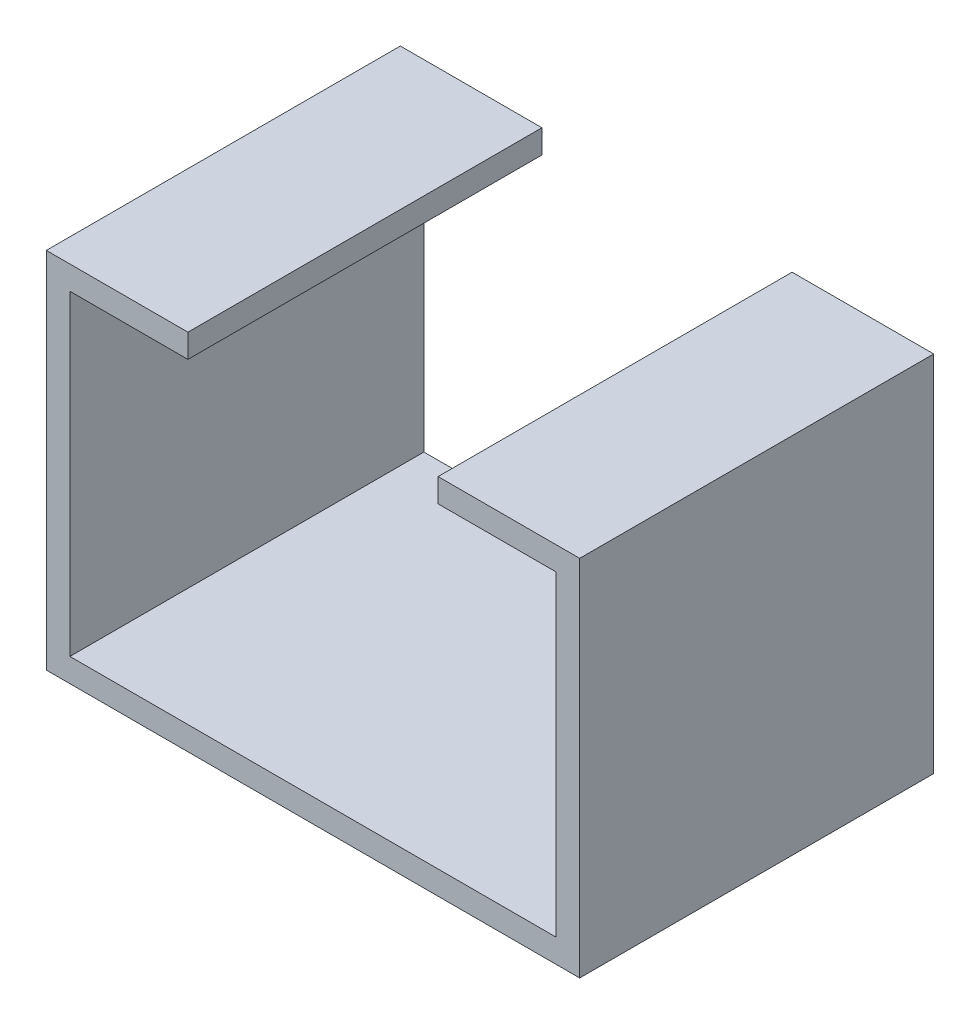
ISO-10303-21;
HEADER;
FILE_DESCRIPTION(('STEP AP214'),'2;1');
FILE_NAME('part.step','',(''),(''),'','','');
FILE_SCHEMA(('AUTOMOTIVE_DESIGN { 1 0 10303 214 1 1 1 1 }'));
ENDSEC;
DATA;
#1=APPLICATION_CONTEXT('core data for automotive mechanical design processes');
#2=APPLICATION_PROTOCOL_DEFINITION('international standard','automotive_design',2000,#1);
#3=PRODUCT_CONTEXT('',#1,'mechanical');
#4=PRODUCT('Part','Part','',(#3));
#5=PRODUCT_RELATED_PRODUCT_CATEGORY('part','',(#4));
#6=PRODUCT_DEFINITION_FORMATION('','',#4);
#7=PRODUCT_DEFINITION_CONTEXT('part definition',#1,'design');
#8=PRODUCT_DEFINITION('design','',#6,#7);
#9=PRODUCT_DEFINITION_SHAPE('','',#8);
#10=(LENGTH_UNIT() NAMED_UNIT(*) SI_UNIT(.MILLI.,.METRE.));
#11=(NAMED_UNIT(*) PLANE_ANGLE_UNIT() SI_UNIT($,.RADIAN.));
#12=(NAMED_UNIT(*) SI_UNIT($,.STERADIAN.) SOLID_ANGLE_UNIT());
#13=UNCERTAINTY_MEASURE_WITH_UNIT(LENGTH_MEASURE(1.E-05),#10,'distance_accuracy_value','');
#14=(GEOMETRIC_REPRESENTATION_CONTEXT(3) GLOBAL_UNCERTAINTY_ASSIGNED_CONTEXT((#13)) GLOBAL_UNIT_ASSIGNED_CONTEXT((#10,
#11,#12)) REPRESENTATION_CONTEXT('',''));
#15=CARTESIAN_POINT('',(0.,0.,0.));
#16=DIRECTION('',(0.,0.,1.));
#17=DIRECTION('',(1.,0.,0.));
#18=AXIS2_PLACEMENT_3D('',#15,#16,#17);
#19=CARTESIAN_POINT('',(0.,0.,15.));
#20=DIRECTION('',(-1.,0.,0.));
#21=DIRECTION('',(0.,0.,1.));
#22=AXIS2_PLACEMENT_3D('',#19,#20,#21);
#23=PLANE('',#22);
#24=DIRECTION('',(0.,1.,0.));
#25=VECTOR('',#24,1.);
#26=CARTESIAN_POINT('',(0.,0.,0.));
#27=LINE('',#26,#25);
#28=CARTESIAN_POINT('',(0.,0.,0.));
#29=VERTEX_POINT('',#28);
#30=CARTESIAN_POINT('',(0.,13.4,0.));
#31=VERTEX_POINT('',#30);
#32=EDGE_CURVE('E122',#29,#31,#27,.T.);
#33=ORIENTED_EDGE('',*,*,#32,.T.);
#34=DIRECTION('',(0.,0.,-1.));
#35=VECTOR('',#34,1.);
#36=CARTESIAN_POINT('',(0.,13.4,15.));
#37=LINE('',#36,#35);
#38=CARTESIAN_POINT('',(0.,13.4,15.));
#39=VERTEX_POINT('',#38);
#40=EDGE_CURVE('E11',#39,#31,#37,.T.);
#41=ORIENTED_EDGE('',*,*,#40,.F.);
#42=DIRECTION('',(0.,1.,0.));
#43=VECTOR('',#42,1.);
#44=CARTESIAN_POINT('',(0.,0.,15.));
#45=LINE('',#44,#43);
#46=CARTESIAN_POINT('',(0.,0.,15.));
#47=VERTEX_POINT('',#46);
#48=EDGE_CURVE('E157',#47,#39,#45,.T.);
#49=ORIENTED_EDGE('',*,*,#48,.F.);
#50=DIRECTION('',(0.,0.,-1.));
#51=VECTOR('',#50,1.);
#52=CARTESIAN_POINT('',(0.,0.,15.));
#53=LINE('',#52,#51);
#54=EDGE_CURVE('E135',#47,#29,#53,.T.);
#55=ORIENTED_EDGE('',*,*,#54,.T.);
#56=EDGE_LOOP('',(#33,#41,#49,#55));
#57=FACE_BOUND('',#56,.T.);
#58=ADVANCED_FACE('F30',(#57),#23,.F.);
#59=CARTESIAN_POINT('',(0.,13.4,15.));
#60=DIRECTION('',(0.,1.,0.));
#61=DIRECTION('',(0.,0.,1.));
#62=AXIS2_PLACEMENT_3D('',#59,#60,#61);
#63=PLANE('',#62);
#64=DIRECTION('',(1.,0.,0.));
#65=VECTOR('',#64,1.);
#66=CARTESIAN_POINT('',(0.,13.4,0.));
#67=LINE('',#66,#65);
#68=CARTESIAN_POINT('',(5.,13.4,0.));
#69=VERTEX_POINT('',#68);
#70=EDGE_CURVE('E118',#31,#69,#67,.T.);
#71=ORIENTED_EDGE('',*,*,#70,.T.);
#72=DIRECTION('',(0.,0.,-1.));
#73=VECTOR('',#72,1.);
#74=CARTESIAN_POINT('',(5.,13.4,15.));
#75=LINE('',#74,#73);
#76=CARTESIAN_POINT('',(5.,13.4,15.));
#77=VERTEX_POINT('',#76);
#78=EDGE_CURVE('E37',#77,#69,#75,.T.);
#79=ORIENTED_EDGE('',*,*,#78,.F.);
#80=DIRECTION('',(1.,0.,0.));
#81=VECTOR('',#80,1.);
#82=CARTESIAN_POINT('',(0.,13.4,15.));
#83=LINE('',#82,#81);
#84=EDGE_CURVE('E131',#39,#77,#83,.T.);
#85=ORIENTED_EDGE('',*,*,#84,.F.);
#86=ORIENTED_EDGE('',*,*,#40,.T.);
#87=EDGE_LOOP('',(#71,#79,#85,#86));
#88=FACE_BOUND('',#87,.T.);
#89=ADVANCED_FACE('F130',(#88),#63,.F.);
#90=CARTESIAN_POINT('',(5.,14.4,15.));
#91=DIRECTION('',(-1.,0.,0.));
#92=DIRECTION('',(0.,0.,1.));
#93=AXIS2_PLACEMENT_3D('',#90,#91,#92);
#94=PLANE('',#93);
#95=DIRECTION('',(0.,1.,0.));
#96=VECTOR('',#95,1.);
#97=CARTESIAN_POINT('',(5.,14.4,0.));
#98=LINE('',#97,#96);
#99=CARTESIAN_POINT('',(5.,14.4,0.));
#100=VERTEX_POINT('',#99);
#101=EDGE_CURVE('E124',#69,#100,#98,.T.);
#102=ORIENTED_EDGE('',*,*,#101,.T.);
#103=DIRECTION('',(0.,0.,-1.));
#104=VECTOR('',#103,1.);
#105=CARTESIAN_POINT('',(5.,14.4,15.));
#106=LINE('',#105,#104);
#107=CARTESIAN_POINT('',(5.,14.4,15.));
#108=VERTEX_POINT('',#107);
#109=EDGE_CURVE('E203',#108,#100,#106,.T.);
#110=ORIENTED_EDGE('',*,*,#109,.F.);
#111=DIRECTION('',(0.,1.,0.));
#112=VECTOR('',#111,1.);
#113=CARTESIAN_POINT('',(5.,14.4,15.));
#114=LINE('',#113,#112);
#115=EDGE_CURVE('E160',#77,#108,#114,.T.);
#116=ORIENTED_EDGE('',*,*,#115,.F.);
#117=ORIENTED_EDGE('',*,*,#78,.T.);
#118=EDGE_LOOP('',(#102,#110,#116,#117));
#119=FACE_BOUND('',#118,.T.);
#120=ADVANCED_FACE('F207',(#119),#94,.F.);
#121=CARTESIAN_POINT('',(-1.,14.4,15.));
#122=DIRECTION('',(0.,-1.,0.));
#123=DIRECTION('',(0.,0.,-1.));
#124=AXIS2_PLACEMENT_3D('',#121,#122,#123);
#125=PLANE('',#124);
#126=DIRECTION('',(-1.,0.,0.));
#127=VECTOR('',#126,1.);
#128=CARTESIAN_POINT('',(-1.,14.4,0.));
#129=LINE('',#128,#127);
#130=CARTESIAN_POINT('',(-1.,14.4,0.));
#131=VERTEX_POINT('',#130);
#132=EDGE_CURVE('E139',#100,#131,#129,.T.);
#133=ORIENTED_EDGE('',*,*,#132,.T.);
#134=DIRECTION('',(0.,0.,-1.));
#135=VECTOR('',#134,1.);
#136=CARTESIAN_POINT('',(-1.,14.4,15.));
#137=LINE('',#136,#135);
#138=CARTESIAN_POINT('',(-1.,14.4,15.));
#139=VERTEX_POINT('',#138);
#140=EDGE_CURVE('E200',#139,#131,#137,.T.);
#141=ORIENTED_EDGE('',*,*,#140,.F.);
#142=DIRECTION('',(-1.,0.,0.));
#143=VECTOR('',#142,1.);
#144=CARTESIAN_POINT('',(-1.,14.4,15.));
#145=LINE('',#144,#143);
#146=EDGE_CURVE('E162',#108,#139,#145,.T.);
#147=ORIENTED_EDGE('',*,*,#146,.F.);
#148=ORIENTED_EDGE('',*,*,#109,.T.);
#149=EDGE_LOOP('',(#133,#141,#147,#148));
#150=FACE_BOUND('',#149,.T.);
#151=ADVANCED_FACE('F215',(#150),#125,.F.);
#152=CARTESIAN_POINT('',(-1.,-1.,15.));
#153=DIRECTION('',(1.,0.,0.));
#154=DIRECTION('',(0.,0.,-1.));
#155=AXIS2_PLACEMENT_3D('',#152,#153,#154);
#156=PLANE('',#155);
#157=DIRECTION('',(0.,-1.,0.));
#158=VECTOR('',#157,1.);
#159=CARTESIAN_POINT('',(-1.,-1.,0.));
#160=LINE('',#159,#158);
#161=CARTESIAN_POINT('',(-1.,-1.,0.));
#162=VERTEX_POINT('',#161);
#163=EDGE_CURVE('E141',#131,#162,#160,.T.);
#164=ORIENTED_EDGE('',*,*,#163,.T.);
#165=DIRECTION('',(0.,0.,-1.));
#166=VECTOR('',#165,1.);
#167=CARTESIAN_POINT('',(-1.,-1.,15.));
#168=LINE('',#167,#166);
#169=CARTESIAN_POINT('',(-1.,-1.,15.));
#170=VERTEX_POINT('',#169);
#171=EDGE_CURVE('E197',#170,#162,#168,.T.);
#172=ORIENTED_EDGE('',*,*,#171,.F.);
#173=DIRECTION('',(0.,-1.,0.));
#174=VECTOR('',#173,1.);
#175=CARTESIAN_POINT('',(-1.,-1.,15.));
#176=LINE('',#175,#174);
#177=EDGE_CURVE('E164',#139,#170,#176,.T.);
#178=ORIENTED_EDGE('',*,*,#177,.F.);
#179=ORIENTED_EDGE('',*,*,#140,.T.);
#180=EDGE_LOOP('',(#164,#172,#178,#179));
#181=FACE_BOUND('',#180,.T.);
#182=ADVANCED_FACE('F218',(#181),#156,.F.);
#183=CARTESIAN_POINT('',(-1.,-1.,15.));
#184=DIRECTION('',(0.,1.,0.));
#185=DIRECTION('',(0.,0.,1.));
#186=AXIS2_PLACEMENT_3D('',#183,#184,#185);
#187=PLANE('',#186);
#188=DIRECTION('',(1.,0.,0.));
#189=VECTOR('',#188,1.);
#190=CARTESIAN_POINT('',(-1.,-1.,0.));
#191=LINE('',#190,#189);
#192=CARTESIAN_POINT('',(21.6,-1.,0.));
#193=VERTEX_POINT('',#192);
#194=EDGE_CURVE('E143',#162,#193,#191,.T.);
#195=ORIENTED_EDGE('',*,*,#194,.T.);
#196=DIRECTION('',(0.,0.,-1.));
#197=VECTOR('',#196,1.);
#198=CARTESIAN_POINT('',(21.6,-1.,15.));
#199=LINE('',#198,#197);
#200=CARTESIAN_POINT('',(21.6,-1.,15.));
#201=VERTEX_POINT('',#200);
#202=EDGE_CURVE('E194',#201,#193,#199,.T.);
#203=ORIENTED_EDGE('',*,*,#202,.F.);
#204=DIRECTION('',(1.,0.,0.));
#205=VECTOR('',#204,1.);
#206=CARTESIAN_POINT('',(-1.,-1.,15.));
#207=LINE('',#206,#205);
#208=EDGE_CURVE('E166',#170,#201,#207,.T.);
#209=ORIENTED_EDGE('',*,*,#208,.F.);
#210=ORIENTED_EDGE('',*,*,#171,.T.);
#211=EDGE_LOOP('',(#195,#203,#209,#210));
#212=FACE_BOUND('',#211,.T.);
#213=ADVANCED_FACE('F223',(#212),#187,.F.);
#214=CARTESIAN_POINT('',(21.6,-1.,15.));
#215=DIRECTION('',(-1.,0.,0.));
#216=DIRECTION('',(0.,0.,1.));
#217=AXIS2_PLACEMENT_3D('',#214,#215,#216);
#218=PLANE('',#217);
#219=DIRECTION('',(0.,1.,0.));
#220=VECTOR('',#219,1.);
#221=CARTESIAN_POINT('',(21.6,-1.,0.));
#222=LINE('',#221,#220);
#223=CARTESIAN_POINT('',(21.6,14.4,0.));
#224=VERTEX_POINT('',#223);
#225=EDGE_CURVE('E145',#193,#224,#222,.T.);
#226=ORIENTED_EDGE('',*,*,#225,.T.);
#227=DIRECTION('',(0.,0.,-1.));
#228=VECTOR('',#227,1.);
#229=CARTESIAN_POINT('',(21.6,14.4,15.));
#230=LINE('',#229,#228);
#231=CARTESIAN_POINT('',(21.6,14.4,15.));
#232=VERTEX_POINT('',#231);
#233=EDGE_CURVE('E191',#232,#224,#230,.T.);
#234=ORIENTED_EDGE('',*,*,#233,.F.);
#235=DIRECTION('',(0.,1.,0.));
#236=VECTOR('',#235,1.);
#237=CARTESIAN_POINT('',(21.6,-1.,15.));
#238=LINE('',#237,#236);
#239=EDGE_CURVE('E168',#201,#232,#238,.T.);
#240=ORIENTED_EDGE('',*,*,#239,.F.);
#241=ORIENTED_EDGE('',*,*,#202,.T.);
#242=EDGE_LOOP('',(#226,#234,#240,#241));
#243=FACE_BOUND('',#242,.T.);
#244=ADVANCED_FACE('F229',(#243),#218,.F.);
#245=CARTESIAN_POINT('',(21.6,14.4,15.));
#246=DIRECTION('',(0.,-1.,0.));
#247=DIRECTION('',(0.,0.,-1.));
#248=AXIS2_PLACEMENT_3D('',#245,#246,#247);
#249=PLANE('',#248);
#250=DIRECTION('',(-1.,0.,0.));
#251=VECTOR('',#250,1.);
#252=CARTESIAN_POINT('',(21.6,14.4,0.));
#253=LINE('',#252,#251);
#254=CARTESIAN_POINT('',(15.6,14.4,0.));
#255=VERTEX_POINT('',#254);
#256=EDGE_CURVE('E147',#224,#255,#253,.T.);
#257=ORIENTED_EDGE('',*,*,#256,.T.);
#258=DIRECTION('',(0.,0.,-1.));
#259=VECTOR('',#258,1.);
#260=CARTESIAN_POINT('',(15.6,14.4,15.));
#261=LINE('',#260,#259);
#262=CARTESIAN_POINT('',(15.6,14.4,15.));
#263=VERTEX_POINT('',#262);
#264=EDGE_CURVE('E188',#263,#255,#261,.T.);
#265=ORIENTED_EDGE('',*,*,#264,.F.);
#266=DIRECTION('',(-1.,0.,0.));
#267=VECTOR('',#266,1.);
#268=CARTESIAN_POINT('',(21.6,14.4,15.));
#269=LINE('',#268,#267);
#270=EDGE_CURVE('E170',#232,#263,#269,.T.);
#271=ORIENTED_EDGE('',*,*,#270,.F.);
#272=ORIENTED_EDGE('',*,*,#233,.T.);
#273=EDGE_LOOP('',(#257,#265,#271,#272));
#274=FACE_BOUND('',#273,.T.);
#275=ADVANCED_FACE('F233',(#274),#249,.F.);
#276=CARTESIAN_POINT('',(15.6,14.4,15.));
#277=DIRECTION('',(1.,0.,0.));
#278=DIRECTION('',(0.,0.,-1.));
#279=AXIS2_PLACEMENT_3D('',#276,#277,#278);
#280=PLANE('',#279);
#281=DIRECTION('',(0.,-1.,0.));
#282=VECTOR('',#281,1.);
#283=CARTESIAN_POINT('',(15.6,14.4,0.));
#284=LINE('',#283,#282);
#285=CARTESIAN_POINT('',(15.6,13.4,0.));
#286=VERTEX_POINT('',#285);
#287=EDGE_CURVE('E149',#255,#286,#284,.T.);
#288=ORIENTED_EDGE('',*,*,#287,.T.);
#289=DIRECTION('',(0.,0.,-1.));
#290=VECTOR('',#289,1.);
#291=CARTESIAN_POINT('',(15.6,13.4,15.));
#292=LINE('',#291,#290);
#293=CARTESIAN_POINT('',(15.6,13.4,15.));
#294=VERTEX_POINT('',#293);
#295=EDGE_CURVE('E185',#294,#286,#292,.T.);
#296=ORIENTED_EDGE('',*,*,#295,.F.);
#297=DIRECTION('',(0.,-1.,0.));
#298=VECTOR('',#297,1.);
#299=CARTESIAN_POINT('',(15.6,14.4,15.));
#300=LINE('',#299,#298);
#301=EDGE_CURVE('E172',#263,#294,#300,.T.);
#302=ORIENTED_EDGE('',*,*,#301,.F.);
#303=ORIENTED_EDGE('',*,*,#264,.T.);
#304=EDGE_LOOP('',(#288,#296,#302,#303));
#305=FACE_BOUND('',#304,.T.);
#306=ADVANCED_FACE('F238',(#305),#280,.F.);
#307=CARTESIAN_POINT('',(20.6,13.4,15.));
#308=DIRECTION('',(0.,1.,0.));
#309=DIRECTION('',(-1.,0.,0.));
#310=AXIS2_PLACEMENT_3D('',#307,#308,#309);
#311=PLANE('',#310);
#312=DIRECTION('',(1.,0.,0.));
#313=VECTOR('',#312,1.);
#314=CARTESIAN_POINT('',(20.6,13.4,0.));
#315=LINE('',#314,#313);
#316=CARTESIAN_POINT('',(20.6,13.4,0.));
#317=VERTEX_POINT('',#316);
#318=EDGE_CURVE('E151',#286,#317,#315,.T.);
#319=ORIENTED_EDGE('',*,*,#318,.T.);
#320=DIRECTION('',(0.,0.,-1.));
#321=VECTOR('',#320,1.);
#322=CARTESIAN_POINT('',(20.6,13.4,15.));
#323=LINE('',#322,#321);
#324=CARTESIAN_POINT('',(20.6,13.4,15.));
#325=VERTEX_POINT('',#324);
#326=EDGE_CURVE('E182',#325,#317,#323,.T.);
#327=ORIENTED_EDGE('',*,*,#326,.F.);
#328=DIRECTION('',(1.,0.,0.));
#329=VECTOR('',#328,1.);
#330=CARTESIAN_POINT('',(20.6,13.4,15.));
#331=LINE('',#330,#329);
#332=EDGE_CURVE('E174',#294,#325,#331,.T.);
#333=ORIENTED_EDGE('',*,*,#332,.F.);
#334=ORIENTED_EDGE('',*,*,#295,.T.);
#335=EDGE_LOOP('',(#319,#327,#333,#334));
#336=FACE_BOUND('',#335,.T.);
#337=ADVANCED_FACE('F242',(#336),#311,.F.);
#338=CARTESIAN_POINT('',(20.6,0.,15.));
#339=DIRECTION('',(1.,0.,0.));
#340=DIRECTION('',(0.,0.,-1.));
#341=AXIS2_PLACEMENT_3D('',#338,#339,#340);
#342=PLANE('',#341);
#343=DIRECTION('',(0.,-1.,0.));
#344=VECTOR('',#343,1.);
#345=CARTESIAN_POINT('',(20.6,0.,0.));
#346=LINE('',#345,#344);
#347=CARTESIAN_POINT('',(20.6,0.,0.));
#348=VERTEX_POINT('',#347);
#349=EDGE_CURVE('E153',#317,#348,#346,.T.);
#350=ORIENTED_EDGE('',*,*,#349,.T.);
#351=DIRECTION('',(0.,0.,-1.));
#352=VECTOR('',#351,1.);
#353=CARTESIAN_POINT('',(20.6,0.,15.));
#354=LINE('',#353,#352);
#355=CARTESIAN_POINT('',(20.6,0.,15.));
#356=VERTEX_POINT('',#355);
#357=EDGE_CURVE('E179',#356,#348,#354,.T.);
#358=ORIENTED_EDGE('',*,*,#357,.F.);
#359=DIRECTION('',(0.,-1.,0.));
#360=VECTOR('',#359,1.);
#361=CARTESIAN_POINT('',(20.6,0.,15.));
#362=LINE('',#361,#360);
#363=EDGE_CURVE('E49',#325,#356,#362,.T.);
#364=ORIENTED_EDGE('',*,*,#363,.F.);
#365=ORIENTED_EDGE('',*,*,#326,.T.);
#366=EDGE_LOOP('',(#350,#358,#364,#365));
#367=FACE_BOUND('',#366,.T.);
#368=ADVANCED_FACE('F246',(#367),#342,.F.);
#369=CARTESIAN_POINT('',(0.,0.,15.));
#370=DIRECTION('',(0.,-1.,0.));
#371=DIRECTION('',(0.,0.,-1.));
#372=AXIS2_PLACEMENT_3D('',#369,#370,#371);
#373=PLANE('',#372);
#374=DIRECTION('',(-1.,0.,0.));
#375=VECTOR('',#374,1.);
#376=CARTESIAN_POINT('',(0.,0.,0.));
#377=LINE('',#376,#375);
#378=EDGE_CURVE('E155',#348,#29,#377,.T.);
#379=ORIENTED_EDGE('',*,*,#378,.T.);
#380=ORIENTED_EDGE('',*,*,#54,.F.);
#381=DIRECTION('',(-1.,0.,0.));
#382=VECTOR('',#381,1.);
#383=CARTESIAN_POINT('',(0.,0.,15.));
#384=LINE('',#383,#382);
#385=EDGE_CURVE('E44',#356,#47,#384,.T.);
#386=ORIENTED_EDGE('',*,*,#385,.F.);
#387=ORIENTED_EDGE('',*,*,#357,.T.);
#388=EDGE_LOOP('',(#379,#380,#386,#387));
#389=FACE_BOUND('',#388,.T.);
#390=ADVANCED_FACE('F248',(#389),#373,.F.);
#391=CARTESIAN_POINT('',(0.,13.4,15.));
#392=DIRECTION('',(0.,0.,-1.));
#393=DIRECTION('',(-1.,0.,0.));
#394=AXIS2_PLACEMENT_3D('',#391,#392,#393);
#395=PLANE('',#394);
#396=ORIENTED_EDGE('',*,*,#48,.T.);
#397=ORIENTED_EDGE('',*,*,#84,.T.);
#398=ORIENTED_EDGE('',*,*,#115,.T.);
#399=ORIENTED_EDGE('',*,*,#146,.T.);
#400=ORIENTED_EDGE('',*,*,#177,.T.);
#401=ORIENTED_EDGE('',*,*,#208,.T.);
#402=ORIENTED_EDGE('',*,*,#239,.T.);
#403=ORIENTED_EDGE('',*,*,#270,.T.);
#404=ORIENTED_EDGE('',*,*,#301,.T.);
#405=ORIENTED_EDGE('',*,*,#332,.T.);
#406=ORIENTED_EDGE('',*,*,#363,.T.);
#407=ORIENTED_EDGE('',*,*,#385,.T.);
#408=EDGE_LOOP('',(#396,#397,#398,#399,#400,#401,#402,#403,#404,#405,#406,#407));
#409=FACE_BOUND('',#408,.T.);
#410=ADVANCED_FACE('F210',(#409),#395,.F.);
#411=CARTESIAN_POINT('',(0.,13.4,0.));
#412=DIRECTION('',(0.,0.,-1.));
#413=DIRECTION('',(-1.,0.,0.));
#414=AXIS2_PLACEMENT_3D('',#411,#412,#413);
#415=PLANE('',#414);
#416=ORIENTED_EDGE('',*,*,#32,.F.);
#417=ORIENTED_EDGE('',*,*,#378,.F.);
#418=ORIENTED_EDGE('',*,*,#349,.F.);
#419=ORIENTED_EDGE('',*,*,#318,.F.);
#420=ORIENTED_EDGE('',*,*,#287,.F.);
#421=ORIENTED_EDGE('',*,*,#256,.F.);
#422=ORIENTED_EDGE('',*,*,#225,.F.);
#423=ORIENTED_EDGE('',*,*,#194,.F.);
#424=ORIENTED_EDGE('',*,*,#163,.F.);
#425=ORIENTED_EDGE('',*,*,#132,.F.);
#426=ORIENTED_EDGE('',*,*,#101,.F.);
#427=ORIENTED_EDGE('',*,*,#70,.F.);
#428=EDGE_LOOP('',(#416,#417,#418,#419,#420,#421,#422,#423,#424,#425,#426,#427));
#429=FACE_BOUND('',#428,.T.);
#430=ADVANCED_FACE('F119',(#429),#415,.T.);
#431=CLOSED_SHELL('',(#58,#89,#120,#151,#182,#213,#244,#275,#306,#337,#368,#390,#410,#430));
#432=MANIFOLD_SOLID_BREP('B2',#431);
#433=ADVANCED_BREP_SHAPE_REPRESENTATION('',(#18,#432),#14);
#434=SHAPE_DEFINITION_REPRESENTATION(#9,#433);
ENDSEC;
END-ISO-10303-21;
